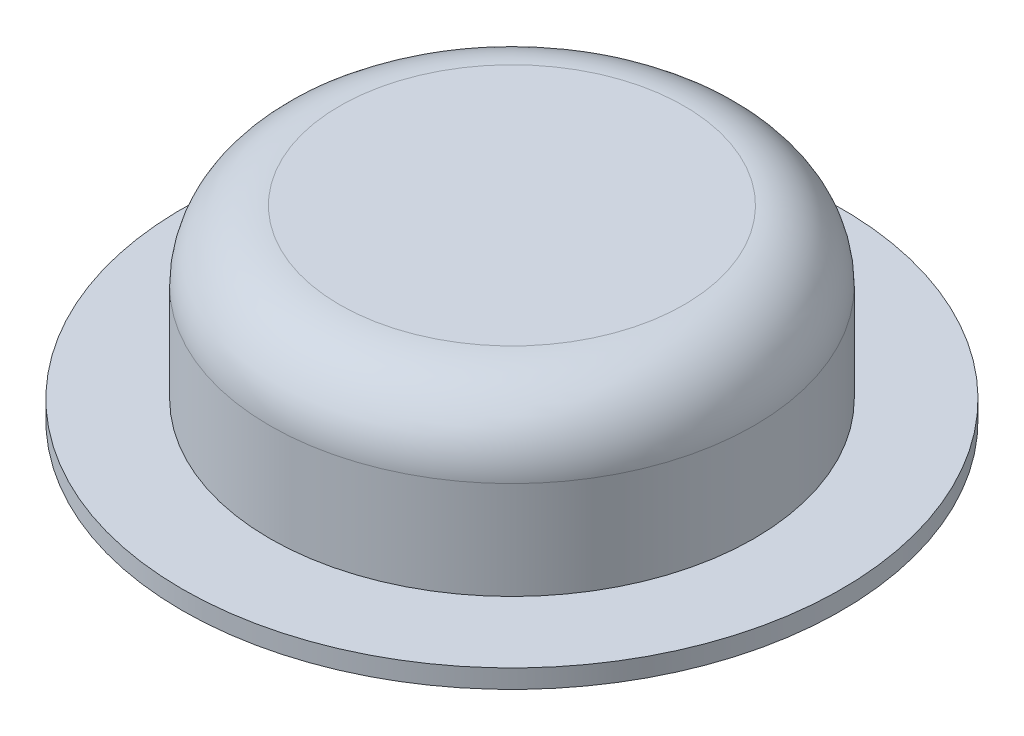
ISO-10303-21;
HEADER;
FILE_DESCRIPTION(('STEP AP214'),'2;1');
FILE_NAME('part.step','',(''),(''),'','','');
FILE_SCHEMA(('AUTOMOTIVE_DESIGN { 1 0 10303 214 1 1 1 1 }'));
ENDSEC;
DATA;
#1=APPLICATION_CONTEXT('core data for automotive mechanical design processes');
#2=APPLICATION_PROTOCOL_DEFINITION('international standard','automotive_design',2000,#1);
#3=PRODUCT_CONTEXT('',#1,'mechanical');
#4=PRODUCT('Part','Part','',(#3));
#5=PRODUCT_RELATED_PRODUCT_CATEGORY('part','',(#4));
#6=PRODUCT_DEFINITION_FORMATION('','',#4);
#7=PRODUCT_DEFINITION_CONTEXT('part definition',#1,'design');
#8=PRODUCT_DEFINITION('design','',#6,#7);
#9=PRODUCT_DEFINITION_SHAPE('','',#8);
#10=(LENGTH_UNIT() NAMED_UNIT(*) SI_UNIT(.MILLI.,.METRE.));
#11=(NAMED_UNIT(*) PLANE_ANGLE_UNIT() SI_UNIT($,.RADIAN.));
#12=(NAMED_UNIT(*) SI_UNIT($,.STERADIAN.) SOLID_ANGLE_UNIT());
#13=UNCERTAINTY_MEASURE_WITH_UNIT(LENGTH_MEASURE(1.E-05),#10,'distance_accuracy_value','');
#14=(GEOMETRIC_REPRESENTATION_CONTEXT(3) GLOBAL_UNCERTAINTY_ASSIGNED_CONTEXT((#13)) GLOBAL_UNIT_ASSIGNED_CONTEXT((#10,
#11,#12)) REPRESENTATION_CONTEXT('',''));
#15=CARTESIAN_POINT('',(0.,0.,0.));
#16=DIRECTION('',(0.,0.,1.));
#17=DIRECTION('',(1.,0.,0.));
#18=AXIS2_PLACEMENT_3D('',#15,#16,#17);
#19=CARTESIAN_POINT('',(0.,2.54,0.));
#20=DIRECTION('',(0.,-1.,0.));
#21=DIRECTION('',(0.,0.,-1.));
#22=AXIS2_PLACEMENT_3D('',#19,#20,#21);
#23=CYLINDRICAL_SURFACE('',#22,44.958);
#24=CARTESIAN_POINT('',(0.,2.54,0.));
#25=DIRECTION('',(0.,1.,0.));
#26=DIRECTION('',(0.,0.,1.));
#27=AXIS2_PLACEMENT_3D('',#24,#25,#26);
#28=CIRCLE('',#27,44.958);
#29=CARTESIAN_POINT('',(0.,2.54,44.958));
#30=VERTEX_POINT('',#29);
#31=EDGE_CURVE('E44',#30,#30,#28,.T.);
#32=ORIENTED_EDGE('',*,*,#31,.F.);
#33=EDGE_LOOP('',(#32));
#34=FACE_BOUND('',#33,.T.);
#35=CARTESIAN_POINT('',(0.,0.,0.));
#36=DIRECTION('',(0.,1.,0.));
#37=DIRECTION('',(0.,0.,1.));
#38=AXIS2_PLACEMENT_3D('',#35,#36,#37);
#39=CIRCLE('',#38,44.958);
#40=CARTESIAN_POINT('',(0.,0.,44.958));
#41=VERTEX_POINT('',#40);
#42=EDGE_CURVE('E48',#41,#41,#39,.T.);
#43=ORIENTED_EDGE('',*,*,#42,.T.);
#44=EDGE_LOOP('',(#43));
#45=FACE_BOUND('',#44,.T.);
#46=ADVANCED_FACE('F33',(#34,#45),#23,.T.);
#47=CARTESIAN_POINT('',(0.,2.54,0.));
#48=DIRECTION('',(0.,1.,0.));
#49=DIRECTION('',(0.,0.,1.));
#50=AXIS2_PLACEMENT_3D('',#47,#48,#49);
#51=PLANE('',#50);
#52=CARTESIAN_POINT('',(0.,2.54,0.));
#53=DIRECTION('',(0.,1.,0.));
#54=DIRECTION('',(0.,0.,1.));
#55=AXIS2_PLACEMENT_3D('',#52,#53,#54);
#56=CIRCLE('',#55,33.02);
#57=CARTESIAN_POINT('',(0.,2.54,33.02));
#58=VERTEX_POINT('',#57);
#59=EDGE_CURVE('E52',#58,#58,#56,.T.);
#60=ORIENTED_EDGE('',*,*,#59,.F.);
#61=EDGE_LOOP('',(#60));
#62=FACE_BOUND('',#61,.T.);
#63=ORIENTED_EDGE('',*,*,#31,.T.);
#64=EDGE_LOOP('',(#63));
#65=FACE_BOUND('',#64,.T.);
#66=ADVANCED_FACE('F59',(#62,#65),#51,.T.);
#67=CARTESIAN_POINT('',(0.,0.,0.));
#68=DIRECTION('',(0.,1.,0.));
#69=DIRECTION('',(0.,0.,1.));
#70=AXIS2_PLACEMENT_3D('',#67,#68,#69);
#71=PLANE('',#70);
#72=ORIENTED_EDGE('',*,*,#42,.F.);
#73=EDGE_LOOP('',(#72));
#74=FACE_BOUND('',#73,.T.);
#75=ADVANCED_FACE('F62',(#74),#71,.F.);
#76=CARTESIAN_POINT('',(0.,25.4,0.));
#77=DIRECTION('',(0.,-1.,0.));
#78=DIRECTION('',(0.,0.,-1.));
#79=AXIS2_PLACEMENT_3D('',#76,#77,#78);
#80=CYLINDRICAL_SURFACE('',#79,33.02);
#81=CARTESIAN_POINT('',(0.,15.875,0.));
#82=DIRECTION('',(0.,1.,0.));
#83=DIRECTION('',(0.,0.,1.));
#84=AXIS2_PLACEMENT_3D('',#81,#82,#83);
#85=CIRCLE('',#84,33.02);
#86=CARTESIAN_POINT('',(0.,15.875,33.02));
#87=VERTEX_POINT('',#86);
#88=EDGE_CURVE('E10',#87,#87,#85,.F.);
#89=ORIENTED_EDGE('',*,*,#88,.T.);
#90=EDGE_LOOP('',(#89));
#91=FACE_BOUND('',#90,.T.);
#92=ORIENTED_EDGE('',*,*,#59,.T.);
#93=EDGE_LOOP('',(#92));
#94=FACE_BOUND('',#93,.T.);
#95=ADVANCED_FACE('F57',(#91,#94),#80,.T.);
#96=CARTESIAN_POINT('',(0.,25.4,0.));
#97=DIRECTION('',(0.,1.,0.));
#98=DIRECTION('',(0.,0.,1.));
#99=AXIS2_PLACEMENT_3D('',#96,#97,#98);
#100=PLANE('',#99);
#101=CARTESIAN_POINT('',(0.,25.4,0.));
#102=DIRECTION('',(0.,1.,0.));
#103=DIRECTION('',(0.,0.,1.));
#104=AXIS2_PLACEMENT_3D('',#101,#102,#103);
#105=CIRCLE('',#104,23.495);
#106=CARTESIAN_POINT('',(0.,25.4,23.495));
#107=VERTEX_POINT('',#106);
#108=EDGE_CURVE('E40',#107,#107,#105,.T.);
#109=ORIENTED_EDGE('',*,*,#108,.T.);
#110=EDGE_LOOP('',(#109));
#111=FACE_BOUND('',#110,.T.);
#112=ADVANCED_FACE('F75',(#111),#100,.T.);
#113=CARTESIAN_POINT('',(0.,15.875,0.));
#114=DIRECTION('',(0.,1.,0.));
#115=DIRECTION('',(0.,0.,1.));
#116=AXIS2_PLACEMENT_3D('',#113,#114,#115);
#117=TOROIDAL_SURFACE('',#116,23.495,9.525);
#118=ORIENTED_EDGE('',*,*,#88,.F.);
#119=EDGE_LOOP('',(#118));
#120=FACE_BOUND('',#119,.T.);
#121=ORIENTED_EDGE('',*,*,#108,.F.);
#122=EDGE_LOOP('',(#121));
#123=FACE_BOUND('',#122,.T.);
#124=ADVANCED_FACE('F35',(#120,#123),#117,.T.);
#125=CLOSED_SHELL('',(#46,#66,#75,#95,#112,#124));
#126=MANIFOLD_SOLID_BREP('B2',#125);
#127=ADVANCED_BREP_SHAPE_REPRESENTATION('',(#18,#126),#14);
#128=SHAPE_DEFINITION_REPRESENTATION(#9,#127);
ENDSEC;
END-ISO-10303-21;
